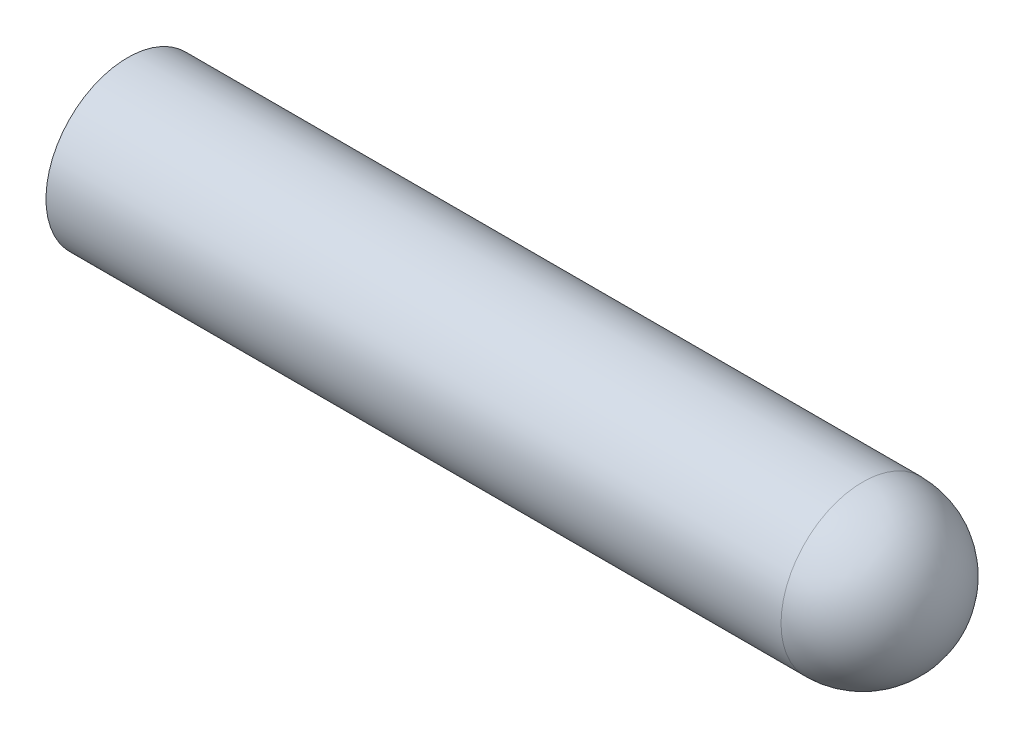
ISO-10303-21;
HEADER;
FILE_DESCRIPTION(('STEP AP214'),'2;1');
FILE_NAME('part.step','',(''),(''),'','','');
FILE_SCHEMA(('AUTOMOTIVE_DESIGN { 1 0 10303 214 1 1 1 1 }'));
ENDSEC;
DATA;
#1=APPLICATION_CONTEXT('core data for automotive mechanical design processes');
#2=APPLICATION_PROTOCOL_DEFINITION('international standard','automotive_design',2000,#1);
#3=PRODUCT_CONTEXT('',#1,'mechanical');
#4=PRODUCT('Part','Part','',(#3));
#5=PRODUCT_RELATED_PRODUCT_CATEGORY('part','',(#4));
#6=PRODUCT_DEFINITION_FORMATION('','',#4);
#7=PRODUCT_DEFINITION_CONTEXT('part definition',#1,'design');
#8=PRODUCT_DEFINITION('design','',#6,#7);
#9=PRODUCT_DEFINITION_SHAPE('','',#8);
#10=(LENGTH_UNIT() NAMED_UNIT(*) SI_UNIT(.MILLI.,.METRE.));
#11=(NAMED_UNIT(*) PLANE_ANGLE_UNIT() SI_UNIT($,.RADIAN.));
#12=(NAMED_UNIT(*) SI_UNIT($,.STERADIAN.) SOLID_ANGLE_UNIT());
#13=UNCERTAINTY_MEASURE_WITH_UNIT(LENGTH_MEASURE(1.E-05),#10,'distance_accuracy_value','');
#14=(GEOMETRIC_REPRESENTATION_CONTEXT(3) GLOBAL_UNCERTAINTY_ASSIGNED_CONTEXT((#13)) GLOBAL_UNIT_ASSIGNED_CONTEXT((#10,
#11,#12)) REPRESENTATION_CONTEXT('',''));
#15=CARTESIAN_POINT('',(0.,0.,0.));
#16=DIRECTION('',(0.,0.,1.));
#17=DIRECTION('',(1.,0.,0.));
#18=AXIS2_PLACEMENT_3D('',#15,#16,#17);
#19=CARTESIAN_POINT('',(24.875,129.35,0.));
#20=DIRECTION('',(-1.,0.,0.));
#21=DIRECTION('',(0.,-1.,0.));
#22=AXIS2_PLACEMENT_3D('',#19,#20,#21);
#23=CYLINDRICAL_SURFACE('',#22,2.4875);
#24=CARTESIAN_POINT('',(22.3875,129.35,0.));
#25=DIRECTION('',(-1.,0.,0.));
#26=DIRECTION('',(0.,0.,1.));
#27=AXIS2_PLACEMENT_3D('',#24,#25,#26);
#28=CIRCLE('',#27,2.4875);
#29=CARTESIAN_POINT('',(22.3875,129.35,2.48749999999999));
#30=VERTEX_POINT('',#29);
#31=EDGE_CURVE('E10',#30,#30,#28,.T.);
#32=ORIENTED_EDGE('',*,*,#31,.T.);
#33=EDGE_LOOP('',(#32));
#34=FACE_BOUND('',#33,.T.);
#35=CARTESIAN_POINT('',(0.,129.35,0.));
#36=DIRECTION('',(-1.,0.,0.));
#37=DIRECTION('',(0.,-1.,0.));
#38=AXIS2_PLACEMENT_3D('',#35,#36,#37);
#39=CIRCLE('',#38,2.4875);
#40=CARTESIAN_POINT('',(0.,126.8625,0.));
#41=VERTEX_POINT('',#40);
#42=EDGE_CURVE('E21',#41,#41,#39,.T.);
#43=ORIENTED_EDGE('',*,*,#42,.F.);
#44=EDGE_LOOP('',(#43));
#45=FACE_BOUND('',#44,.T.);
#46=ADVANCED_FACE('F14',(#34,#45),#23,.T.);
#47=CARTESIAN_POINT('',(0.,129.35,0.));
#48=DIRECTION('',(-1.,0.,0.));
#49=DIRECTION('',(0.,-1.,0.));
#50=AXIS2_PLACEMENT_3D('',#47,#48,#49);
#51=PLANE('',#50);
#52=ORIENTED_EDGE('',*,*,#42,.T.);
#53=EDGE_LOOP('',(#52));
#54=FACE_BOUND('',#53,.T.);
#55=ADVANCED_FACE('F46',(#54),#51,.T.);
#56=CARTESIAN_POINT('',(22.3875,129.35,0.));
#57=DIRECTION('',(0.,0.,1.));
#58=DIRECTION('',(1.,0.,0.));
#59=AXIS2_PLACEMENT_3D('',#56,#57,#58);
#60=SPHERICAL_SURFACE('',#59,2.4875);
#61=CARTESIAN_POINT('',(22.3875,129.35,0.));
#62=DIRECTION('',(-1.,0.,0.));
#63=DIRECTION('',(0.,0.,1.));
#64=AXIS2_PLACEMENT_3D('',#61,#62,#63);
#65=SPHERICAL_SURFACE('',#64,2.4875);
#66=ORIENTED_EDGE('',*,*,#31,.F.);
#67=EDGE_LOOP('',(#66));
#68=FACE_BOUND('',#67,.T.);
#69=ADVANCED_FACE('F54',(#68),#65,.T.);
#70=CLOSED_SHELL('',(#46,#55,#69));
#71=MANIFOLD_SOLID_BREP('B1',#70);
#72=ADVANCED_BREP_SHAPE_REPRESENTATION('',(#18,#71),#14);
#73=SHAPE_DEFINITION_REPRESENTATION(#9,#72);
ENDSEC;
END-ISO-10303-21;
